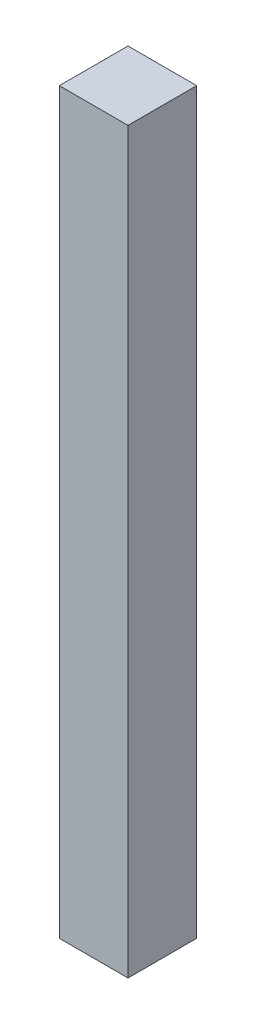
from build123d import *

# Parameters (mm, degrees)
ESQUISSE1_W        = 67
ESQUISSE1_H        = 67
BOSS_EXTRU_1_DEPTH = 720


with BuildPart() as part:
    # Esquisse1 → Boss.-Extru.1 (new body)
    with BuildSketch(Plane(origin=(0, 0, 0), x_dir=(1, 0, 0), z_dir=(0, 1, 0))):
        Rectangle(ESQUISSE1_W, ESQUISSE1_H)
    extrude(amount=BOSS_EXTRU_1_DEPTH)


solid = part.part
